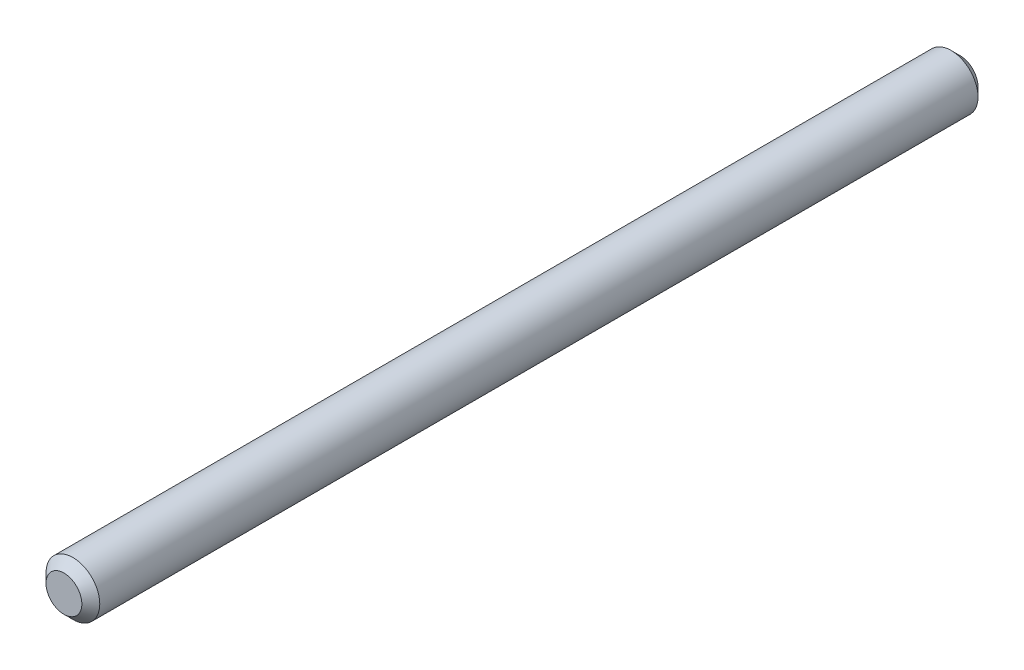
from build123d import *

# Parameters (mm, degrees)
ESQUISSE1_R          = 1.5
BASE_EXTRUSION_DEPTH = 25
CHANFREIN1_SIZE      = 0.5


with BuildPart() as part:
    # Esquisse1 → Base-Extrusion (new, symmetric)
    with BuildSketch(Plane.XY):
        Circle(ESQUISSE1_R)
    extrude(amount=BASE_EXTRUSION_DEPTH, both=True)

    # Chanfrein1
    chanfrein1_edges = [part.edges().sort_by_distance(p)[0] for p in [
        (-1.5, 0, -25),
        (-1.5, 0, 25),
    ]]
    chamfer(chanfrein1_edges, length=CHANFREIN1_SIZE)


solid = part.part
